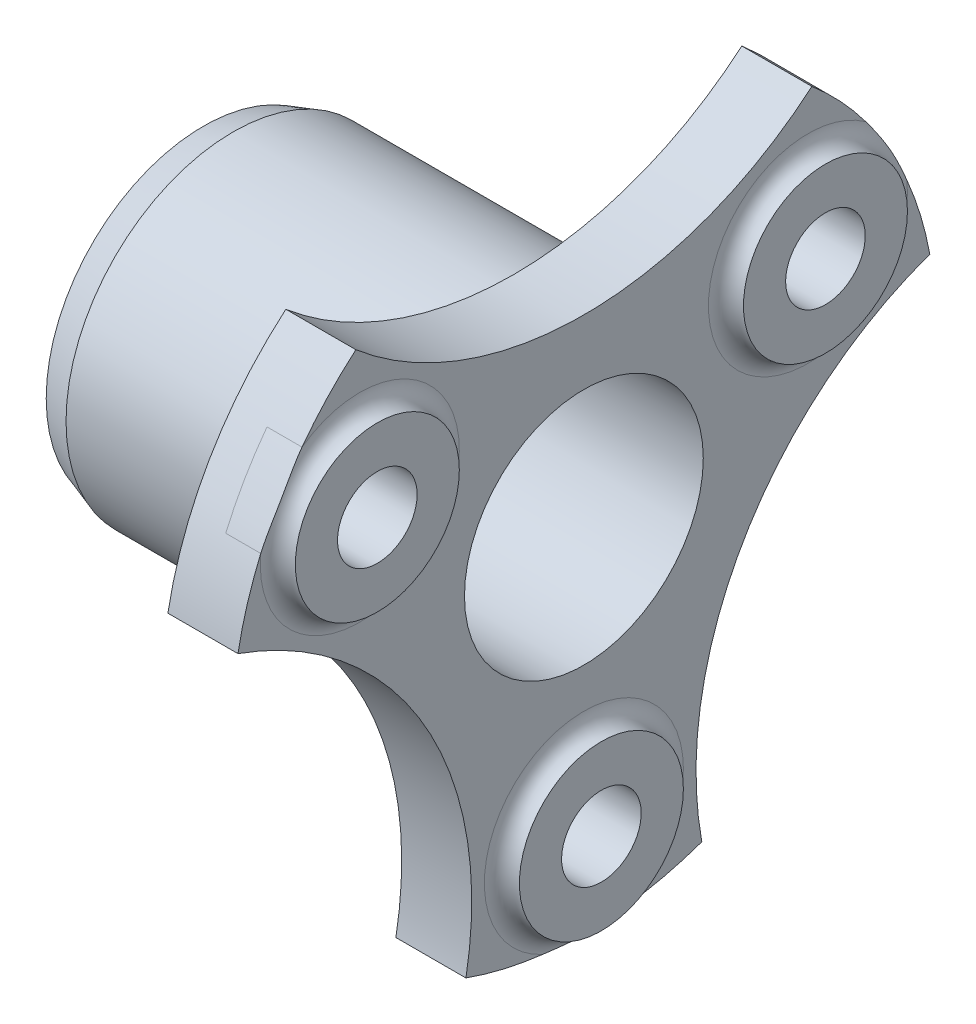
ISO-10303-21;
HEADER;
FILE_DESCRIPTION(('STEP AP214'),'2;1');
FILE_NAME('part.step','',(''),(''),'','','');
FILE_SCHEMA(('AUTOMOTIVE_DESIGN { 1 0 10303 214 1 1 1 1 }'));
ENDSEC;
DATA;
#1=APPLICATION_CONTEXT('core data for automotive mechanical design processes');
#2=APPLICATION_PROTOCOL_DEFINITION('international standard','automotive_design',2000,#1);
#3=PRODUCT_CONTEXT('',#1,'mechanical');
#4=PRODUCT('Part','Part','',(#3));
#5=PRODUCT_RELATED_PRODUCT_CATEGORY('part','',(#4));
#6=PRODUCT_DEFINITION_FORMATION('','',#4);
#7=PRODUCT_DEFINITION_CONTEXT('part definition',#1,'design');
#8=PRODUCT_DEFINITION('design','',#6,#7);
#9=PRODUCT_DEFINITION_SHAPE('','',#8);
#10=(LENGTH_UNIT() NAMED_UNIT(*) SI_UNIT(.MILLI.,.METRE.));
#11=(NAMED_UNIT(*) PLANE_ANGLE_UNIT() SI_UNIT($,.RADIAN.));
#12=(NAMED_UNIT(*) SI_UNIT($,.STERADIAN.) SOLID_ANGLE_UNIT());
#13=UNCERTAINTY_MEASURE_WITH_UNIT(LENGTH_MEASURE(1.E-05),#10,'distance_accuracy_value','');
#14=(GEOMETRIC_REPRESENTATION_CONTEXT(3) GLOBAL_UNCERTAINTY_ASSIGNED_CONTEXT((#13)) GLOBAL_UNIT_ASSIGNED_CONTEXT((#10,
#11,#12)) REPRESENTATION_CONTEXT('',''));
#15=CARTESIAN_POINT('',(0.,0.,0.));
#16=DIRECTION('',(0.,0.,1.));
#17=DIRECTION('',(1.,0.,0.));
#18=AXIS2_PLACEMENT_3D('',#15,#16,#17);
#19=CARTESIAN_POINT('',(0.,16.25,28.1458256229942));
#20=DIRECTION('',(-1.,0.,0.));
#21=DIRECTION('',(0.,-0.866025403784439,0.5));
#22=AXIS2_PLACEMENT_3D('',#19,#20,#21);
#23=TOROIDAL_SURFACE('',#22,12.5,2.2);
#24=CARTESIAN_POINT('',(0.,16.25,28.1458256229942));
#25=DIRECTION('',(-1.,0.,0.));
#26=DIRECTION('',(0.,-0.866025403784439,0.5));
#27=AXIS2_PLACEMENT_3D('',#24,#25,#26);
#28=CIRCLE('',#27,10.3);
#29=CARTESIAN_POINT('',(0.,7.32993834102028,33.2958256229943));
#30=VERTEX_POINT('',#29);
#31=EDGE_CURVE('E347',#30,#30,#28,.T.);
#32=ORIENTED_EDGE('',*,*,#31,.T.);
#33=EDGE_LOOP('',(#32));
#34=FACE_BOUND('',#33,.T.);
#35=CARTESIAN_POINT('',(-2.2,16.25,28.1458256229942));
#36=DIRECTION('',(-1.,0.,0.));
#37=DIRECTION('',(0.,0.5,0.866025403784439));
#38=AXIS2_PLACEMENT_3D('',#35,#36,#37);
#39=CIRCLE('',#38,12.5);
#40=CARTESIAN_POINT('',(-2.2,26.4258219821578,35.4054844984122));
#41=VERTEX_POINT('',#40);
#42=CARTESIAN_POINT('',(-2.2,17.4491380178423,40.58817540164));
#43=VERTEX_POINT('',#42);
#44=EDGE_CURVE('E206',#41,#43,#39,.T.);
#45=ORIENTED_EDGE('',*,*,#44,.F.);
#46=CARTESIAN_POINT('',(2.00000000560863E-07,30.4268934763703,32.032429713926));
#47=CARTESIAN_POINT('',(-0.0340599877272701,30.4268985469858,32.0324245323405));
#48=CARTESIAN_POINT('',(-0.0681012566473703,30.4257836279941,32.0334839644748));
#49=CARTESIAN_POINT('',(-0.135886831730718,30.4213691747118,32.0376764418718));
#50=CARTESIAN_POINT('',(-0.1696313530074,30.4180713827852,32.0408078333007));
#51=CARTESIAN_POINT('',(-0.269506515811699,30.4050629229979,32.053154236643));
#52=CARTESIAN_POINT('',(-0.334903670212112,30.3922349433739,32.0653236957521));
#53=CARTESIAN_POINT('',(-0.461810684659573,30.3592921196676,32.0965151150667));
#54=CARTESIAN_POINT('',(-0.523331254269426,30.3391984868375,32.115517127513));
#55=CARTESIAN_POINT('',(-0.642020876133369,30.2929322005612,32.1591616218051));
#56=CARTESIAN_POINT('',(-0.699180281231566,30.266746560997,32.1838161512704));
#57=CARTESIAN_POINT('',(-0.845469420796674,30.190327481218,32.2555542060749));
#58=CARTESIAN_POINT('',(-0.930370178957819,30.1357343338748,32.3066000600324));
#59=CARTESIAN_POINT('',(-1.08769602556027,30.0173110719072,32.4166625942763));
#60=CARTESIAN_POINT('',(-1.16008056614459,29.9534521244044,32.4757041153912));
#61=CARTESIAN_POINT('',(-1.28440447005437,29.8288243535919,32.5901792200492));
#62=CARTESIAN_POINT('',(-1.33778738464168,29.7688717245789,32.6449631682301));
#63=CARTESIAN_POINT('',(-1.43739418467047,29.6454518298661,32.7570838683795));
#64=CARTESIAN_POINT('',(-1.4836125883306,29.5819819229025,32.8144225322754));
#65=CARTESIAN_POINT('',(-1.56975028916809,29.4523969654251,32.9307804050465));
#66=CARTESIAN_POINT('',(-1.60966917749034,29.3862817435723,32.9897997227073));
#67=CARTESIAN_POINT('',(-1.68398268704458,29.2519660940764,33.10895586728));
#68=CARTESIAN_POINT('',(-1.71837516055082,29.183764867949,33.1690931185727));
#69=CARTESIAN_POINT('',(-1.81566695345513,28.9736527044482,33.3531848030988));
#70=CARTESIAN_POINT('',(-1.87085029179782,28.8291103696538,33.478230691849));
#71=CARTESIAN_POINT('',(-1.96531317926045,28.5353864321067,33.7289423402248));
#72=CARTESIAN_POINT('',(-2.00457496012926,28.3861998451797,33.8546086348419));
#73=CARTESIAN_POINT('',(-2.07053314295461,28.0837647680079,34.1059144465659));
#74=CARTESIAN_POINT('',(-2.09716390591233,27.9304993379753,34.2315505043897));
#75=CARTESIAN_POINT('',(-2.12936998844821,27.6987775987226,34.4188900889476));
#76=CARTESIAN_POINT('',(-2.13881370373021,27.6212560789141,34.4811327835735));
#77=CARTESIAN_POINT('',(-2.15539390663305,27.4656500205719,34.6052072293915));
#78=CARTESIAN_POINT('',(-2.16253061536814,27.3875655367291,34.66703901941));
#79=CARTESIAN_POINT('',(-2.18295985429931,27.1257317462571,34.8729343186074));
#80=CARTESIAN_POINT('',(-2.19165877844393,26.9408216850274,35.015984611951));
#81=CARTESIAN_POINT('',(-2.20066541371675,26.5686100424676,35.2992364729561));
#82=CARTESIAN_POINT('',(-2.20097083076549,26.3813078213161,35.4394372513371));
#83=CARTESIAN_POINT('',(-2.19564288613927,26.0043633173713,35.7169472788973));
#84=CARTESIAN_POINT('',(-2.19000310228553,25.8147187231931,35.8542532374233));
#85=CARTESIAN_POINT('',(-2.17500337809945,25.433366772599,36.1257671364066));
#86=CARTESIAN_POINT('',(-2.16564319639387,25.2416592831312,36.2599748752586));
#87=CARTESIAN_POINT('',(-2.14522384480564,24.8558107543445,36.525553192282));
#88=CARTESIAN_POINT('',(-2.13416127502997,24.6616655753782,36.6569174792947));
#89=CARTESIAN_POINT('',(-2.1122194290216,24.271298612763,36.9165465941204));
#90=CARTESIAN_POINT('',(-2.10134015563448,24.0750767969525,37.0448113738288));
#91=CARTESIAN_POINT('',(-2.08140376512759,23.6807141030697,37.2981374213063));
#92=CARTESIAN_POINT('',(-2.07234511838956,23.4825749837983,37.4232013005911));
#93=CARTESIAN_POINT('',(-2.05732980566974,23.0842465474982,37.6702120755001));
#94=CARTESIAN_POINT('',(-2.05137307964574,22.8840572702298,37.7921590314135));
#95=CARTESIAN_POINT('',(-2.04340256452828,22.4819175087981,38.0327572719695));
#96=CARTESIAN_POINT('',(-2.04138456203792,22.2799691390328,38.1514119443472));
#97=CARTESIAN_POINT('',(-2.04156117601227,21.8742113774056,38.3854938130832));
#98=CARTESIAN_POINT('',(-2.0437558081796,21.6704019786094,38.5009209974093));
#99=CARTESIAN_POINT('',(-2.05205272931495,21.2609317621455,38.7285434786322));
#100=CARTESIAN_POINT('',(-2.05815702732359,21.0552700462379,38.8407370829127));
#101=CARTESIAN_POINT('',(-2.07341822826,20.6422796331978,39.0617914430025));
#102=CARTESIAN_POINT('',(-2.08257514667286,20.4349509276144,39.1706521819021));
#103=CARTESIAN_POINT('',(-2.10263139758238,20.0187621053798,39.3849758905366));
#104=CARTESIAN_POINT('',(-2.11352986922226,19.8099027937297,39.4904405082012));
#105=CARTESIAN_POINT('',(-2.13544036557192,19.3905399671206,39.6980364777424));
#106=CARTESIAN_POINT('',(-2.14645239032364,19.1800364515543,39.8001678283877));
#107=CARTESIAN_POINT('',(-2.16671949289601,18.757451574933,40.001064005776));
#108=CARTESIAN_POINT('',(-2.17597531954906,18.5453709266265,40.0998302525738));
#109=CARTESIAN_POINT('',(-2.19069016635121,18.1195648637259,40.2940257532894));
#110=CARTESIAN_POINT('',(-2.19614956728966,17.9058396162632,40.3894553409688));
#111=CARTESIAN_POINT('',(-2.20016413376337,17.5531300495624,40.5435910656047));
#112=CARTESIAN_POINT('',(-2.20048431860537,17.4145993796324,40.6032865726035));
#113=CARTESIAN_POINT('',(-2.19796501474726,17.1369635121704,40.721242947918));
#114=CARTESIAN_POINT('',(-2.19512575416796,16.9978583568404,40.7795039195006));
#115=CARTESIAN_POINT('',(-2.18557572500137,16.7189432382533,40.8946467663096));
#116=CARTESIAN_POINT('',(-2.17885878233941,16.5791325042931,40.9515262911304));
#117=CARTESIAN_POINT('',(-2.16076467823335,16.2991872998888,41.0637508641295));
#118=CARTESIAN_POINT('',(-2.14938743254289,16.1590528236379,41.1190958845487));
#119=CARTESIAN_POINT('',(-2.1184071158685,15.8520815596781,41.2385248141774));
#120=CARTESIAN_POINT('',(-2.09765248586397,15.6852259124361,41.3022731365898));
#121=CARTESIAN_POINT('',(-2.046567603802,15.3520508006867,41.4272684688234));
#122=CARTESIAN_POINT('',(-2.01623964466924,15.185731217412,41.488516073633));
#123=CARTESIAN_POINT('',(-1.94396721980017,14.855074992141,41.6080516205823));
#124=CARTESIAN_POINT('',(-1.9020566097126,14.6907340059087,41.6663476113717));
#125=CARTESIAN_POINT('',(-1.80390836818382,14.3653059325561,41.7796597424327));
#126=CARTESIAN_POINT('',(-1.74768715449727,14.2042153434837,41.8346795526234));
#127=CARTESIAN_POINT('',(-1.6370851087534,13.9360189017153,41.92461452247));
#128=CARTESIAN_POINT('',(-1.5873241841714,13.8273668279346,41.9605635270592));
#129=CARTESIAN_POINT('',(-1.47741822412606,13.6144188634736,42.0301383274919));
#130=CARTESIAN_POINT('',(-1.41726317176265,13.5101272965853,42.063761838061));
#131=CARTESIAN_POINT('',(-1.28410806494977,13.3076318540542,42.1282650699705));
#132=CARTESIAN_POINT('',(-1.21100010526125,13.2094893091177,42.1591181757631));
#133=CARTESIAN_POINT('',(-1.05008823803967,13.0245972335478,42.216602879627));
#134=CARTESIAN_POINT('',(-0.9623215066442,12.9378198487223,42.2432448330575));
#135=CARTESIAN_POINT('',(-0.807852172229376,12.8127928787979,42.2812870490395));
#136=CARTESIAN_POINT('',(-0.746275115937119,12.768812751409,42.2945803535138));
#137=CARTESIAN_POINT('',(-0.617029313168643,12.6898457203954,42.3183401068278));
#138=CARTESIAN_POINT('',(-0.549364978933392,12.6548523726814,42.328808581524));
#139=CARTESIAN_POINT('',(-0.416864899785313,12.5997352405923,42.3452453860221));
#140=CARTESIAN_POINT('',(-0.352601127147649,12.5783629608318,42.3515931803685));
#141=CARTESIAN_POINT('',(-0.221306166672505,12.546306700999,42.3611011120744));
#142=CARTESIAN_POINT('',(-0.154282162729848,12.5355966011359,42.3642690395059));
#143=CARTESIAN_POINT('',(-0.0579529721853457,12.5285037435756,42.366366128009));
#144=CARTESIAN_POINT('',(-0.0289709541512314,12.5274315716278,42.3666828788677));
#145=CARTESIAN_POINT('',(1.99999997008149E-07,12.5274511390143,42.3666775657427));
#146=B_SPLINE_CURVE_WITH_KNOTS('',3,(#46,#47,#48,#49,#50,#51,#52,#53,#54,#55,#56,#57,#58,#59,
#60,#61,#62,#63,#64,#65,#66,#67,#68,#69,#70,#71,#72,#73,#74,#75,#76,#77,#78,#79,#80,#81,#82,#83,
#84,#85,#86,#87,#88,#89,#90,#91,#92,#93,#94,#95,#96,#97,#98,#99,#100,#101,#102,#103,#104,#105,
#106,#107,#108,#109,#110,#111,#112,#113,#114,#115,#116,#117,#118,#119,#120,#121,#122,#123,#124,
#125,#126,#127,#128,#129,#130,#131,#132,#133,#134,#135,#136,#137,#138,#139,#140,#141,#142,#143,
#144,#145),.UNSPECIFIED.,.F.,.F.,(4,2,2,2,2,2,2,2,2,2,2,2,2,2,2,2,2,2,2,2,2,2,2,2,2,2,2,2,2,2,2,
2,2,2,2,2,2,2,2,2,2,2,2,2,2,2,2,2,2,4),(0.,0.102110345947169,0.204139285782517,
0.406348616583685,0.60797232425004,0.810029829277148,1.14742165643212,1.48588682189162,
1.77703153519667,2.06839792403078,2.35978321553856,2.6512814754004,3.24704691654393,
3.84347540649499,4.44297025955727,4.7425420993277,5.0420852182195,5.74365582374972,
6.44541817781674,7.14793937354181,7.85050615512,8.55449471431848,9.25849419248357,
9.96189970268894,10.665291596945,11.3679306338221,12.0705722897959,12.7735752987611,
13.476581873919,14.1792420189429,14.8819024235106,15.5842625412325,16.2865522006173,
16.7390560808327,17.1915272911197,17.6447209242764,18.0979227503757,18.6371598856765,
19.1762679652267,19.7138166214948,20.2507513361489,20.6247296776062,20.9990704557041,
21.3766904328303,21.7533668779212,21.9832091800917,22.2128862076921,22.4161071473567,
22.6188290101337,22.7057547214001),.UNSPECIFIED.);
#147=EDGE_CURVE('E245',#41,#43,#146,.T.);
#148=ORIENTED_EDGE('',*,*,#147,.T.);
#149=EDGE_LOOP('',(#45,#148));
#150=FACE_BOUND('',#149,.T.);
#151=ADVANCED_FACE('F12',(#34,#150),#23,.F.);
#152=CARTESIAN_POINT('',(0.,16.25,-28.1458256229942));
#153=DIRECTION('',(-1.,0.,0.));
#154=DIRECTION('',(0.,0.866025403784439,0.5));
#155=AXIS2_PLACEMENT_3D('',#152,#153,#154);
#156=TOROIDAL_SURFACE('',#155,12.5,2.2);
#157=CARTESIAN_POINT('',(0.,16.25,-28.1458256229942));
#158=DIRECTION('',(-1.,0.,0.));
#159=DIRECTION('',(0.,0.866025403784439,0.5));
#160=AXIS2_PLACEMENT_3D('',#157,#158,#159);
#161=CIRCLE('',#160,10.3);
#162=CARTESIAN_POINT('',(0.,25.1700616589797,-22.9958256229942));
#163=VERTEX_POINT('',#162);
#164=EDGE_CURVE('E376',#163,#163,#161,.T.);
#165=ORIENTED_EDGE('',*,*,#164,.T.);
#166=EDGE_LOOP('',(#165));
#167=FACE_BOUND('',#166,.T.);
#168=CARTESIAN_POINT('',(-2.2,16.25,-28.1458256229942));
#169=DIRECTION('',(-1.,0.,0.));
#170=DIRECTION('',(0.,0.5,0.866025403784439));
#171=AXIS2_PLACEMENT_3D('',#168,#169,#170);
#172=CIRCLE('',#171,12.5);
#173=CARTESIAN_POINT('',(-2.2,17.4491380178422,-40.58817540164));
#174=VERTEX_POINT('',#173);
#175=CARTESIAN_POINT('',(-2.2,26.4258219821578,-35.4054844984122));
#176=VERTEX_POINT('',#175);
#177=EDGE_CURVE('E212',#174,#176,#172,.T.);
#178=ORIENTED_EDGE('',*,*,#177,.F.);
#179=CARTESIAN_POINT('',(-1.89565730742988,14.6763753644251,-41.6710499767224));
#180=CARTESIAN_POINT('',(-1.93140408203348,14.8069866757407,-41.6250533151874));
#181=CARTESIAN_POINT('',(-1.96292795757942,14.9383367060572,-41.5780982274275));
#182=CARTESIAN_POINT('',(-2.01863762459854,15.2018501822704,-41.4824744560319));
#183=CARTESIAN_POINT('',(-2.0428294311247,15.3340128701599,-41.4338072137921));
#184=CARTESIAN_POINT('',(-2.08494005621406,15.5980916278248,-41.3351151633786));
#185=CARTESIAN_POINT('',(-2.10288739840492,15.7300060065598,-41.2850976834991));
#186=CARTESIAN_POINT('',(-2.13354849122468,15.993897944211,-41.1835843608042));
#187=CARTESIAN_POINT('',(-2.14626104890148,16.125875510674,-41.1320881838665));
#188=CARTESIAN_POINT('',(-2.1776384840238,16.5202947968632,-40.9759922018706));
#189=CARTESIAN_POINT('',(-2.18972179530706,16.7824441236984,-40.8693288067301));
#190=CARTESIAN_POINT('',(-2.20146646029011,17.305201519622,-40.6507424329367));
#191=CARTESIAN_POINT('',(-2.20110809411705,17.5658064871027,-40.5388113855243));
#192=CARTESIAN_POINT('',(-2.19340588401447,18.0172808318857,-40.3397328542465));
#193=CARTESIAN_POINT('',(-2.18790063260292,18.2086815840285,-40.2536995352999));
#194=CARTESIAN_POINT('',(-2.17401270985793,18.5901535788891,-40.078954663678));
#195=CARTESIAN_POINT('',(-2.16562994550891,18.7802247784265,-39.9902430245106));
#196=CARTESIAN_POINT('',(-2.14745431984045,19.159089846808,-39.8101204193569));
#197=CARTESIAN_POINT('',(-2.13766098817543,19.3478832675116,-39.7187085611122));
#198=CARTESIAN_POINT('',(-2.11801740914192,19.7241403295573,-39.5332098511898));
#199=CARTESIAN_POINT('',(-2.10816716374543,19.9116040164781,-39.4391230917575));
#200=CARTESIAN_POINT('',(-2.08961645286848,20.2851823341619,-39.248283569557));
#201=CARTESIAN_POINT('',(-2.08091576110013,20.4712972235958,-39.1515313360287));
#202=CARTESIAN_POINT('',(-2.0656684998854,20.8422008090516,-38.9553472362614));
#203=CARTESIAN_POINT('',(-2.05912192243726,21.0269895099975,-38.8559153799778));
#204=CARTESIAN_POINT('',(-2.04892651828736,21.3951287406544,-38.6544289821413));
#205=CARTESIAN_POINT('',(-2.04527665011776,21.5784797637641,-38.5523753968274));
#206=CARTESIAN_POINT('',(-2.04128186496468,21.9437366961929,-38.3456497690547));
#207=CARTESIAN_POINT('',(-2.04093693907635,22.1256426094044,-38.2409777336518));
#208=CARTESIAN_POINT('',(-2.04360295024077,22.4895270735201,-38.0281263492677));
#209=CARTESIAN_POINT('',(-2.04664358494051,22.6714920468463,-37.9199241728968));
#210=CARTESIAN_POINT('',(-2.0557802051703,23.033789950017,-37.7009512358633));
#211=CARTESIAN_POINT('',(-2.06187619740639,23.2141228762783,-37.5901804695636));
#212=CARTESIAN_POINT('',(-2.07642502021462,23.5731744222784,-37.3660628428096));
#213=CARTESIAN_POINT('',(-2.0848787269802,23.751892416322,-37.2527150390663));
#214=CARTESIAN_POINT('',(-2.10315241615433,24.1076326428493,-37.0234955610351));
#215=CARTESIAN_POINT('',(-2.11297241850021,24.2846548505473,-36.9076238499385));
#216=CARTESIAN_POINT('',(-2.13281702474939,24.6377894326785,-36.672835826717));
#217=CARTESIAN_POINT('',(-2.1428423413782,24.8138943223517,-36.553908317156));
#218=CARTESIAN_POINT('',(-2.16166929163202,25.1644036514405,-36.3135009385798));
#219=CARTESIAN_POINT('',(-2.17047100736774,25.3388082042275,-36.1920212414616));
#220=CARTESIAN_POINT('',(-2.18534670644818,25.6858647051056,-35.9465423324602));
#221=CARTESIAN_POINT('',(-2.19142175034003,25.8585173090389,-35.8225441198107));
#222=CARTESIAN_POINT('',(-2.19918596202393,26.2021178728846,-35.5719925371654));
#223=CARTESIAN_POINT('',(-2.200874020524,26.3730653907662,-35.4454385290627));
#224=CARTESIAN_POINT('',(-2.19953483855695,26.5431062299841,-35.3176430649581));
#225=B_SPLINE_CURVE_WITH_KNOTS('',3,(#179,#180,#181,#182,#183,#184,#185,#186,#187,#188,#189,
#190,#191,#192,#193,#194,#195,#196,#197,#198,#199,#200,#201,#202,#203,#204,#205,#206,#207,#208,
#209,#210,#211,#212,#213,#214,#215,#216,#217,#218,#219,#220,#221,#222,#223,#224),.UNSPECIFIED.,
.F.,.F.,(4,2,2,2,2,2,2,2,2,2,2,2,2,2,2,2,2,2,2,2,2,2,4),(0.,0.428867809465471,0.85738282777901,
1.28391394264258,1.71054220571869,2.55986049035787,3.4105249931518,4.04023702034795,
4.66996940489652,5.29991225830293,5.92983341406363,6.55963038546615,7.18942501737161,
7.81899311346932,8.44855951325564,9.08369219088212,9.71882626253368,10.3541966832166,
10.9895763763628,11.627765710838,12.2659121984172,12.9038102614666,13.5418696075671),.UNSPECIFIED.);
#226=EDGE_CURVE('E239',#174,#176,#225,.T.);
#227=ORIENTED_EDGE('',*,*,#226,.T.);
#228=EDGE_LOOP('',(#178,#227));
#229=FACE_BOUND('',#228,.T.);
#230=ADVANCED_FACE('F253',(#167,#229),#156,.F.);
#231=CARTESIAN_POINT('',(0.,-32.5,0.));
#232=DIRECTION('',(-1.,0.,0.));
#233=DIRECTION('',(0.,0.,-1.));
#234=AXIS2_PLACEMENT_3D('',#231,#232,#233);
#235=TOROIDAL_SURFACE('',#234,12.5,2.2);
#236=CARTESIAN_POINT('',(0.,-32.5,0.));
#237=DIRECTION('',(-1.,0.,0.));
#238=DIRECTION('',(0.,0.,-1.));
#239=AXIS2_PLACEMENT_3D('',#236,#237,#238);
#240=CIRCLE('',#239,10.3);
#241=CARTESIAN_POINT('',(0.,-32.5,-10.3));
#242=VERTEX_POINT('',#241);
#243=EDGE_CURVE('E137',#242,#242,#240,.T.);
#244=ORIENTED_EDGE('',*,*,#243,.T.);
#245=EDGE_LOOP('',(#244));
#246=FACE_BOUND('',#245,.T.);
#247=CARTESIAN_POINT('',(-2.2,-32.5,0.));
#248=DIRECTION('',(-1.,0.,0.));
#249=DIRECTION('',(0.,0.5,0.866025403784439));
#250=AXIS2_PLACEMENT_3D('',#247,#248,#249);
#251=CIRCLE('',#250,12.5);
#252=CARTESIAN_POINT('',(-2.2,-43.87496,5.18269090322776));
#253=VERTEX_POINT('',#252);
#254=CARTESIAN_POINT('',(-2.2,-43.87496,-5.18269090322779));
#255=VERTEX_POINT('',#254);
#256=EDGE_CURVE('E124',#253,#255,#251,.T.);
#257=ORIENTED_EDGE('',*,*,#256,.F.);
#258=CARTESIAN_POINT('',(-2.19953483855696,-43.857529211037,5.3281827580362));
#259=CARTESIAN_POINT('',(-2.20069857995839,-43.8796701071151,5.14593892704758));
#260=CARTESIAN_POINT('',(-2.19959772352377,-43.9006732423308,4.96356615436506));
#261=CARTESIAN_POINT('',(-2.19395411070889,-43.9403961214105,4.59865811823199));
#262=CARTESIAN_POINT('',(-2.18941203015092,-43.9591163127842,4.41612289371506));
#263=CARTESIAN_POINT('',(-2.17797005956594,-43.9942827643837,4.05082406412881));
#264=CARTESIAN_POINT('',(-2.17106901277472,-44.0107279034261,3.86806039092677));
#265=CARTESIAN_POINT('',(-2.15590244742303,-44.0413365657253,3.50239025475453));
#266=CARTESIAN_POINT('',(-2.147636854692,-44.0554999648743,3.3194837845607));
#267=CARTESIAN_POINT('',(-2.13065309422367,-44.0815770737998,2.95309553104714));
#268=CARTESIAN_POINT('',(-2.12193389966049,-44.0934853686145,2.7696134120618));
#269=CARTESIAN_POINT('',(-2.1049198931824,-44.1150111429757,2.40249864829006));
#270=CARTESIAN_POINT('',(-2.09662507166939,-44.1246286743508,2.21886600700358));
#271=CARTESIAN_POINT('',(-2.08122409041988,-44.1415661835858,1.85156951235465));
#272=CARTESIAN_POINT('',(-2.07411712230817,-44.1488877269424,1.66790576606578));
#273=CARTESIAN_POINT('',(-2.06171248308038,-44.1612394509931,1.30043346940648));
#274=CARTESIAN_POINT('',(-2.05641485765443,-44.1662695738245,1.11662491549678));
#275=CARTESIAN_POINT('',(-2.04848432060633,-44.1736658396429,0.766382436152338));
#276=CARTESIAN_POINT('',(-2.0456459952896,-44.1762397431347,0.599957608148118));
#277=CARTESIAN_POINT('',(-2.04202744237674,-44.1795063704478,0.267065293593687));
#278=CARTESIAN_POINT('',(-2.04124722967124,-44.1801990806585,0.100597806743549));
#279=CARTESIAN_POINT('',(-2.04180263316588,-44.1797027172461,-0.232333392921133));
#280=CARTESIAN_POINT('',(-2.04313828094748,-44.178513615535,-0.398797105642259));
#281=CARTESIAN_POINT('',(-2.04782372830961,-44.1742545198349,-0.731673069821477));
#282=CARTESIAN_POINT('',(-2.05117355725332,-44.1711844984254,-0.898085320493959));
#283=CARTESIAN_POINT('',(-2.06394223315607,-44.1591385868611,-1.39790019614));
#284=CARTESIAN_POINT('',(-2.07607750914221,-44.1473279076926,-1.73116824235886));
#285=CARTESIAN_POINT('',(-2.1042089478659,-44.116178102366,-2.39716154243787));
#286=CARTESIAN_POINT('',(-2.12020507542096,-44.0968390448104,-2.72988680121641));
#287=CARTESIAN_POINT('',(-2.15105033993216,-44.0508733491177,-3.39142122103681));
#288=CARTESIAN_POINT('',(-2.16590965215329,-44.0243243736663,-3.72023520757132));
#289=CARTESIAN_POINT('',(-2.18914674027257,-43.9638314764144,-4.37754412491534));
#290=CARTESIAN_POINT('',(-2.19752245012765,-43.9298852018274,-4.70603892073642));
#291=CARTESIAN_POINT('',(-2.20154907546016,-43.8547358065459,-5.3612306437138));
#292=CARTESIAN_POINT('',(-2.19724470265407,-43.8135586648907,-5.68792982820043));
#293=CARTESIAN_POINT('',(-2.17586938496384,-43.7464342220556,-6.17648130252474));
#294=CARTESIAN_POINT('',(-2.1662636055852,-43.7231750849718,-6.33902735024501));
#295=CARTESIAN_POINT('',(-2.14100072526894,-43.6749198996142,-6.66337985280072));
#296=CARTESIAN_POINT('',(-2.12534483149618,-43.6499241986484,-6.82518644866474));
#297=CARTESIAN_POINT('',(-2.09457335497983,-43.6087450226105,-7.08231569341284));
#298=CARTESIAN_POINT('',(-2.08181004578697,-43.5930954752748,-7.17800729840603));
#299=CARTESIAN_POINT('',(-2.05340213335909,-43.561233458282,-7.36890124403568));
#300=CARTESIAN_POINT('',(-2.03775668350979,-43.5450208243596,-7.46410343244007));
#301=CARTESIAN_POINT('',(-2.00319384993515,-43.5120105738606,-7.65419290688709));
#302=CARTESIAN_POINT('',(-1.98426451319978,-43.4952110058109,-7.74907770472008));
#303=CARTESIAN_POINT('',(-1.94277943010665,-43.4611366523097,-7.93796159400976));
#304=CARTESIAN_POINT('',(-1.92022370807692,-43.443861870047,-8.03196069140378));
#305=CARTESIAN_POINT('',(-1.8956573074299,-43.4263755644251,-8.12541108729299));
#306=B_SPLINE_CURVE_WITH_KNOTS('',3,(#258,#259,#260,#261,#262,#263,#264,#265,#266,#267,#268,
#269,#270,#271,#272,#273,#274,#275,#276,#277,#278,#279,#280,#281,#282,#283,#284,#285,#286,#287,
#288,#289,#290,#291,#292,#293,#294,#295,#296,#297,#298,#299,#300,#301,#302,#303,#304,#305),
.UNSPECIFIED.,.F.,.F.,(4,2,2,2,2,2,2,2,2,2,2,2,2,2,2,2,2,2,2,2,2,2,2,4),(0.,0.550711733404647,
1.10131534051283,1.65218933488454,2.20309328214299,2.75530373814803,3.30750169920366,
3.8593223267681,4.41115688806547,4.91054155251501,5.40992983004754,5.90932556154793,
6.4087285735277,7.40967169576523,8.41060569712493,9.40115860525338,10.3920270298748,
11.379405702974,11.872760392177,12.366016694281,12.6593766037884,12.9528228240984,
13.2473604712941,13.5418961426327),.UNSPECIFIED.);
#307=EDGE_CURVE('E9',#253,#255,#306,.T.);
#308=ORIENTED_EDGE('',*,*,#307,.T.);
#309=EDGE_LOOP('',(#257,#308));
#310=FACE_BOUND('',#309,.T.);
#311=ADVANCED_FACE('F125',(#246,#310),#235,.F.);
#312=CARTESIAN_POINT('',(-11.,-16.82,29.1330945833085));
#313=DIRECTION('',(-1.,0.,0.));
#314=DIRECTION('',(0.,0.,1.));
#315=AXIS2_PLACEMENT_3D('',#312,#313,#314);
#316=PLANE('',#315);
#317=CARTESIAN_POINT('',(-11.,-32.5,0.));
#318=DIRECTION('',(-1.,0.,0.));
#319=DIRECTION('',(0.,0.5,0.866025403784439));
#320=AXIS2_PLACEMENT_3D('',#317,#318,#319);
#321=CIRCLE('',#320,5.);
#322=CARTESIAN_POINT('',(-11.,-30.,4.33012701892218));
#323=VERTEX_POINT('',#322);
#324=EDGE_CURVE('E401',#323,#323,#321,.T.);
#325=ORIENTED_EDGE('',*,*,#324,.F.);
#326=EDGE_LOOP('',(#325));
#327=FACE_BOUND('',#326,.T.);
#328=CARTESIAN_POINT('',(-11.,-33.64,58.266189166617));
#329=DIRECTION('',(-1.,0.,0.));
#330=DIRECTION('',(0.,1.,0.));
#331=AXIS2_PLACEMENT_3D('',#328,#329,#330);
#332=CIRCLE('',#331,44.18);
#333=CARTESIAN_POINT('',(-11.,-11.55,20.0051868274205));
#334=VERTEX_POINT('',#333);
#335=CARTESIAN_POINT('',(-11.,-41.6225623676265,14.8133285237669));
#336=VERTEX_POINT('',#335);
#337=EDGE_CURVE('E165',#334,#336,#332,.T.);
#338=ORIENTED_EDGE('',*,*,#337,.F.);
#339=CARTESIAN_POINT('',(-11.,0.,0.));
#340=DIRECTION('',(-1.,0.,0.));
#341=DIRECTION('',(0.,0.,1.));
#342=AXIS2_PLACEMENT_3D('',#339,#340,#341);
#343=CIRCLE('',#342,23.1);
#344=CARTESIAN_POINT('',(-11.,-11.55,-20.0051868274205));
#345=VERTEX_POINT('',#344);
#346=EDGE_CURVE('E202',#334,#345,#343,.F.);
#347=ORIENTED_EDGE('',*,*,#346,.T.);
#348=CARTESIAN_POINT('',(-11.,-33.64,-58.266189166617));
#349=DIRECTION('',(-1.,0.,0.));
#350=DIRECTION('',(0.,1.,0.));
#351=AXIS2_PLACEMENT_3D('',#348,#349,#350);
#352=CIRCLE('',#351,44.18);
#353=CARTESIAN_POINT('',(-11.,-41.6225623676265,-14.8133285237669));
#354=VERTEX_POINT('',#353);
#355=EDGE_CURVE('E172',#354,#345,#352,.T.);
#356=ORIENTED_EDGE('',*,*,#355,.F.);
#357=CARTESIAN_POINT('',(-11.,0.,0.));
#358=DIRECTION('',(-1.,0.,0.));
#359=DIRECTION('',(0.,1.,0.));
#360=AXIS2_PLACEMENT_3D('',#357,#358,#359);
#361=CIRCLE('',#360,44.18);
#362=EDGE_CURVE('E167',#354,#336,#361,.T.);
#363=ORIENTED_EDGE('',*,*,#362,.T.);
#364=EDGE_LOOP('',(#338,#347,#356,#363));
#365=FACE_BOUND('',#364,.T.);
#366=ADVANCED_FACE('F289',(#327,#365),#316,.T.);
#367=CARTESIAN_POINT('',(-11.,16.25,-28.1458256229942));
#368=DIRECTION('',(-1.,0.,0.));
#369=DIRECTION('',(0.,0.5,0.866025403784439));
#370=AXIS2_PLACEMENT_3D('',#367,#368,#369);
#371=CIRCLE('',#370,5.);
#372=CARTESIAN_POINT('',(-11.,18.75,-23.8156986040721));
#373=VERTEX_POINT('',#372);
#374=EDGE_CURVE('E396',#373,#373,#371,.T.);
#375=ORIENTED_EDGE('',*,*,#374,.F.);
#376=EDGE_LOOP('',(#375));
#377=FACE_BOUND('',#376,.T.);
#378=CARTESIAN_POINT('',(-11.,7.98256236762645,-43.4528606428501));
#379=VERTEX_POINT('',#378);
#380=EDGE_CURVE('E170',#345,#379,#352,.T.);
#381=ORIENTED_EDGE('',*,*,#380,.F.);
#382=CARTESIAN_POINT('',(-11.,23.1,0.));
#383=VERTEX_POINT('',#382);
#384=EDGE_CURVE('E200',#345,#383,#343,.F.);
#385=ORIENTED_EDGE('',*,*,#384,.T.);
#386=CARTESIAN_POINT('',(-11.,67.28,0.));
#387=DIRECTION('',(-1.,0.,0.));
#388=DIRECTION('',(0.,1.,0.));
#389=AXIS2_PLACEMENT_3D('',#386,#387,#388);
#390=CIRCLE('',#389,44.18);
#391=CARTESIAN_POINT('',(-11.,33.64,-28.6395321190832));
#392=VERTEX_POINT('',#391);
#393=EDGE_CURVE('E179',#392,#383,#390,.T.);
#394=ORIENTED_EDGE('',*,*,#393,.F.);
#395=CARTESIAN_POINT('',(-11.,0.,0.));
#396=DIRECTION('',(-1.,0.,0.));
#397=DIRECTION('',(0.,1.,0.));
#398=AXIS2_PLACEMENT_3D('',#395,#396,#397);
#399=CIRCLE('',#398,44.18);
#400=EDGE_CURVE('E175',#392,#379,#399,.T.);
#401=ORIENTED_EDGE('',*,*,#400,.T.);
#402=EDGE_LOOP('',(#381,#385,#394,#401));
#403=FACE_BOUND('',#402,.T.);
#404=ADVANCED_FACE('F292',(#377,#403),#316,.T.);
#405=CARTESIAN_POINT('',(-11.,16.25,28.1458256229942));
#406=DIRECTION('',(-1.,0.,0.));
#407=DIRECTION('',(0.,0.5,0.866025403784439));
#408=AXIS2_PLACEMENT_3D('',#405,#406,#407);
#409=CIRCLE('',#408,5.);
#410=CARTESIAN_POINT('',(-11.,18.75,32.4759526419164));
#411=VERTEX_POINT('',#410);
#412=EDGE_CURVE('E246',#411,#411,#409,.T.);
#413=ORIENTED_EDGE('',*,*,#412,.F.);
#414=EDGE_LOOP('',(#413));
#415=FACE_BOUND('',#414,.T.);
#416=CARTESIAN_POINT('',(-11.,33.64,28.6395321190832));
#417=VERTEX_POINT('',#416);
#418=EDGE_CURVE('E178',#383,#417,#390,.T.);
#419=ORIENTED_EDGE('',*,*,#418,.F.);
#420=CARTESIAN_POINT('',(-11.,0.,0.));
#421=DIRECTION('',(1.,0.,0.));
#422=DIRECTION('',(0.,0.,-1.));
#423=AXIS2_PLACEMENT_3D('',#420,#421,#422);
#424=CIRCLE('',#423,23.1);
#425=EDGE_CURVE('E357',#383,#334,#424,.T.);
#426=ORIENTED_EDGE('',*,*,#425,.T.);
#427=CARTESIAN_POINT('',(-11.,7.98256236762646,43.4528606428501));
#428=VERTEX_POINT('',#427);
#429=EDGE_CURVE('E171',#428,#334,#332,.T.);
#430=ORIENTED_EDGE('',*,*,#429,.F.);
#431=CARTESIAN_POINT('',(-11.,0.,0.));
#432=DIRECTION('',(-1.,0.,0.));
#433=DIRECTION('',(0.,1.,0.));
#434=AXIS2_PLACEMENT_3D('',#431,#432,#433);
#435=CIRCLE('',#434,44.18);
#436=EDGE_CURVE('E182',#428,#417,#435,.T.);
#437=ORIENTED_EDGE('',*,*,#436,.T.);
#438=EDGE_LOOP('',(#419,#426,#430,#437));
#439=FACE_BOUND('',#438,.T.);
#440=ADVANCED_FACE('F294',(#415,#439),#316,.T.);
#441=CARTESIAN_POINT('',(-11.,-33.64,58.266189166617));
#442=DIRECTION('',(1.,0.,0.));
#443=DIRECTION('',(0.,0.,-1.));
#444=AXIS2_PLACEMENT_3D('',#441,#442,#443);
#445=CYLINDRICAL_SURFACE('',#444,44.18);
#446=CARTESIAN_POINT('',(-2.2,-33.64,58.266189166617));
#447=DIRECTION('',(-1.,0.,0.));
#448=DIRECTION('',(0.,1.,0.));
#449=AXIS2_PLACEMENT_3D('',#446,#447,#448);
#450=CIRCLE('',#449,44.18);
#451=CARTESIAN_POINT('',(-2.2,7.98256236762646,43.4528606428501));
#452=VERTEX_POINT('',#451);
#453=CARTESIAN_POINT('',(-2.2,-41.6225623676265,14.8133285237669));
#454=VERTEX_POINT('',#453);
#455=EDGE_CURVE('E143',#452,#454,#450,.T.);
#456=ORIENTED_EDGE('',*,*,#455,.F.);
#457=DIRECTION('',(1.,0.,0.));
#458=VECTOR('',#457,1.);
#459=CARTESIAN_POINT('',(-11.,7.98256236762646,43.4528606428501));
#460=LINE('',#459,#458);
#461=EDGE_CURVE('E185',#428,#452,#460,.T.);
#462=ORIENTED_EDGE('',*,*,#461,.F.);
#463=ORIENTED_EDGE('',*,*,#429,.T.);
#464=DIRECTION('',(1.,0.,0.));
#465=VECTOR('',#464,1.);
#466=CARTESIAN_POINT('',(-10.5,-11.55,20.0051868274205));
#467=LINE('',#466,#465);
#468=CARTESIAN_POINT('',(-10.,-11.55,20.0051868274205));
#469=VERTEX_POINT('',#468);
#470=EDGE_CURVE('E151',#334,#469,#467,.T.);
#471=ORIENTED_EDGE('',*,*,#470,.T.);
#472=ORIENTED_EDGE('',*,*,#470,.F.);
#473=ORIENTED_EDGE('',*,*,#337,.T.);
#474=DIRECTION('',(1.,0.,0.));
#475=VECTOR('',#474,1.);
#476=CARTESIAN_POINT('',(-11.,-41.6225623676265,14.8133285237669));
#477=LINE('',#476,#475);
#478=EDGE_CURVE('E198',#336,#454,#477,.T.);
#479=ORIENTED_EDGE('',*,*,#478,.T.);
#480=EDGE_LOOP('',(#456,#462,#463,#471,#472,#473,#479));
#481=FACE_BOUND('',#480,.T.);
#482=ADVANCED_FACE('F14',(#481),#445,.F.);
#483=CARTESIAN_POINT('',(-11.,0.,0.));
#484=DIRECTION('',(1.,0.,0.));
#485=DIRECTION('',(0.,0.,-1.));
#486=AXIS2_PLACEMENT_3D('',#483,#484,#485);
#487=CYLINDRICAL_SURFACE('',#486,44.18);
#488=CARTESIAN_POINT('',(-2.2,0.,0.));
#489=DIRECTION('',(-1.,0.,0.));
#490=DIRECTION('',(0.,1.,0.));
#491=AXIS2_PLACEMENT_3D('',#488,#489,#490);
#492=CIRCLE('',#491,44.18);
#493=CARTESIAN_POINT('',(-2.2,-41.6225623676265,-14.8133285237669));
#494=VERTEX_POINT('',#493);
#495=EDGE_CURVE('E144',#494,#255,#492,.T.);
#496=ORIENTED_EDGE('',*,*,#495,.T.);
#497=DIRECTION('',(-1.,0.,0.));
#498=VECTOR('',#497,1.);
#499=CARTESIAN_POINT('',(-4.4,-43.87496,-5.18269090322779));
#500=LINE('',#499,#498);
#501=CARTESIAN_POINT('',(-6.6,-43.87496,-5.1826909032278));
#502=VERTEX_POINT('',#501);
#503=EDGE_CURVE('E29',#255,#502,#500,.T.);
#504=ORIENTED_EDGE('',*,*,#503,.T.);
#505=CARTESIAN_POINT('',(-6.6,0.,0.));
#506=DIRECTION('',(-1.,0.,0.));
#507=DIRECTION('',(0.,0.5,0.866025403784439));
#508=AXIS2_PLACEMENT_3D('',#505,#506,#507);
#509=CIRCLE('',#508,44.18);
#510=CARTESIAN_POINT('',(-6.6,-43.87496,5.18269090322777));
#511=VERTEX_POINT('',#510);
#512=EDGE_CURVE('E21',#502,#511,#509,.T.);
#513=ORIENTED_EDGE('',*,*,#512,.T.);
#514=DIRECTION('',(-1.,0.,0.));
#515=VECTOR('',#514,1.);
#516=CARTESIAN_POINT('',(-4.4,-43.87496,5.18269090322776));
#517=LINE('',#516,#515);
#518=EDGE_CURVE('E120',#511,#253,#517,.F.);
#519=ORIENTED_EDGE('',*,*,#518,.T.);
#520=EDGE_CURVE('E135',#253,#454,#492,.T.);
#521=ORIENTED_EDGE('',*,*,#520,.T.);
#522=ORIENTED_EDGE('',*,*,#478,.F.);
#523=ORIENTED_EDGE('',*,*,#362,.F.);
#524=DIRECTION('',(1.,0.,0.));
#525=VECTOR('',#524,1.);
#526=CARTESIAN_POINT('',(-11.,-41.6225623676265,-14.8133285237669));
#527=LINE('',#526,#525);
#528=EDGE_CURVE('E197',#354,#494,#527,.T.);
#529=ORIENTED_EDGE('',*,*,#528,.T.);
#530=EDGE_LOOP('',(#496,#504,#513,#519,#521,#522,#523,#529));
#531=FACE_BOUND('',#530,.T.);
#532=ADVANCED_FACE('F133',(#531),#487,.T.);
#533=CARTESIAN_POINT('',(-11.,-33.64,-58.266189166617));
#534=DIRECTION('',(1.,0.,0.));
#535=DIRECTION('',(0.,0.,-1.));
#536=AXIS2_PLACEMENT_3D('',#533,#534,#535);
#537=CYLINDRICAL_SURFACE('',#536,44.18);
#538=CARTESIAN_POINT('',(-2.2,-33.64,-58.266189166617));
#539=DIRECTION('',(-1.,0.,0.));
#540=DIRECTION('',(0.,1.,0.));
#541=AXIS2_PLACEMENT_3D('',#538,#539,#540);
#542=CIRCLE('',#541,44.18);
#543=CARTESIAN_POINT('',(-2.2,7.98256236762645,-43.4528606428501));
#544=VERTEX_POINT('',#543);
#545=EDGE_CURVE('E146',#494,#544,#542,.T.);
#546=ORIENTED_EDGE('',*,*,#545,.F.);
#547=ORIENTED_EDGE('',*,*,#528,.F.);
#548=ORIENTED_EDGE('',*,*,#355,.T.);
#549=DIRECTION('',(1.,0.,0.));
#550=VECTOR('',#549,1.);
#551=CARTESIAN_POINT('',(-10.5,-11.55,-20.0051868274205));
#552=LINE('',#551,#550);
#553=CARTESIAN_POINT('',(-10.,-11.55,-20.0051868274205));
#554=VERTEX_POINT('',#553);
#555=EDGE_CURVE('E326',#345,#554,#552,.T.);
#556=ORIENTED_EDGE('',*,*,#555,.T.);
#557=ORIENTED_EDGE('',*,*,#555,.F.);
#558=ORIENTED_EDGE('',*,*,#380,.T.);
#559=DIRECTION('',(1.,0.,0.));
#560=VECTOR('',#559,1.);
#561=CARTESIAN_POINT('',(-11.,7.98256236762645,-43.4528606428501));
#562=LINE('',#561,#560);
#563=EDGE_CURVE('E194',#379,#544,#562,.T.);
#564=ORIENTED_EDGE('',*,*,#563,.T.);
#565=EDGE_LOOP('',(#546,#547,#548,#556,#557,#558,#564));
#566=FACE_BOUND('',#565,.T.);
#567=ADVANCED_FACE('F305',(#566),#537,.F.);
#568=CARTESIAN_POINT('',(-11.,0.,0.));
#569=DIRECTION('',(1.,0.,0.));
#570=DIRECTION('',(0.,0.,-1.));
#571=AXIS2_PLACEMENT_3D('',#568,#569,#570);
#572=CYLINDRICAL_SURFACE('',#571,44.18);
#573=CARTESIAN_POINT('',(-2.2,0.,0.));
#574=DIRECTION('',(-1.,0.,0.));
#575=DIRECTION('',(0.,1.,0.));
#576=AXIS2_PLACEMENT_3D('',#573,#574,#575);
#577=CIRCLE('',#576,44.18);
#578=CARTESIAN_POINT('',(-2.2,33.64,-28.6395321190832));
#579=VERTEX_POINT('',#578);
#580=EDGE_CURVE('E156',#579,#176,#577,.T.);
#581=ORIENTED_EDGE('',*,*,#580,.T.);
#582=DIRECTION('',(-1.,0.,0.));
#583=VECTOR('',#582,1.);
#584=CARTESIAN_POINT('',(-4.4,26.4258219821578,-35.4054844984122));
#585=LINE('',#584,#583);
#586=CARTESIAN_POINT('',(-6.6,26.4258219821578,-35.4054844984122));
#587=VERTEX_POINT('',#586);
#588=EDGE_CURVE('E36',#176,#587,#585,.T.);
#589=ORIENTED_EDGE('',*,*,#588,.T.);
#590=CARTESIAN_POINT('',(-6.6,0.,0.));
#591=DIRECTION('',(-1.,0.,0.));
#592=DIRECTION('',(0.,0.5,0.866025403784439));
#593=AXIS2_PLACEMENT_3D('',#590,#591,#592);
#594=CIRCLE('',#593,44.18);
#595=CARTESIAN_POINT('',(-6.6,17.4491380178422,-40.58817540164));
#596=VERTEX_POINT('',#595);
#597=EDGE_CURVE('E130',#587,#596,#594,.T.);
#598=ORIENTED_EDGE('',*,*,#597,.T.);
#599=DIRECTION('',(-1.,0.,0.));
#600=VECTOR('',#599,1.);
#601=CARTESIAN_POINT('',(-4.4,17.4491380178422,-40.58817540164));
#602=LINE('',#601,#600);
#603=EDGE_CURVE('E333',#596,#174,#602,.F.);
#604=ORIENTED_EDGE('',*,*,#603,.T.);
#605=EDGE_CURVE('E155',#174,#544,#577,.T.);
#606=ORIENTED_EDGE('',*,*,#605,.T.);
#607=ORIENTED_EDGE('',*,*,#563,.F.);
#608=ORIENTED_EDGE('',*,*,#400,.F.);
#609=DIRECTION('',(1.,0.,0.));
#610=VECTOR('',#609,1.);
#611=CARTESIAN_POINT('',(-11.,33.64,-28.6395321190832));
#612=LINE('',#611,#610);
#613=EDGE_CURVE('E192',#392,#579,#612,.T.);
#614=ORIENTED_EDGE('',*,*,#613,.T.);
#615=EDGE_LOOP('',(#581,#589,#598,#604,#606,#607,#608,#614));
#616=FACE_BOUND('',#615,.T.);
#617=ADVANCED_FACE('F301',(#616),#572,.T.);
#618=CARTESIAN_POINT('',(-11.,67.28,0.));
#619=DIRECTION('',(1.,0.,0.));
#620=DIRECTION('',(0.,0.,-1.));
#621=AXIS2_PLACEMENT_3D('',#618,#619,#620);
#622=CYLINDRICAL_SURFACE('',#621,44.18);
#623=CARTESIAN_POINT('',(-2.2,67.28,0.));
#624=DIRECTION('',(-1.,0.,0.));
#625=DIRECTION('',(0.,1.,0.));
#626=AXIS2_PLACEMENT_3D('',#623,#624,#625);
#627=CIRCLE('',#626,44.18);
#628=CARTESIAN_POINT('',(-2.2,33.64,28.6395321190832));
#629=VERTEX_POINT('',#628);
#630=EDGE_CURVE('E159',#579,#629,#627,.T.);
#631=ORIENTED_EDGE('',*,*,#630,.F.);
#632=ORIENTED_EDGE('',*,*,#613,.F.);
#633=ORIENTED_EDGE('',*,*,#393,.T.);
#634=DIRECTION('',(1.,0.,0.));
#635=VECTOR('',#634,1.);
#636=CARTESIAN_POINT('',(-10.5,23.1,0.));
#637=LINE('',#636,#635);
#638=CARTESIAN_POINT('',(-10.,23.1,0.));
#639=VERTEX_POINT('',#638);
#640=EDGE_CURVE('E205',#383,#639,#637,.T.);
#641=ORIENTED_EDGE('',*,*,#640,.T.);
#642=ORIENTED_EDGE('',*,*,#640,.F.);
#643=ORIENTED_EDGE('',*,*,#418,.T.);
#644=DIRECTION('',(1.,0.,0.));
#645=VECTOR('',#644,1.);
#646=CARTESIAN_POINT('',(-11.,33.64,28.6395321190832));
#647=LINE('',#646,#645);
#648=EDGE_CURVE('E189',#417,#629,#647,.T.);
#649=ORIENTED_EDGE('',*,*,#648,.T.);
#650=EDGE_LOOP('',(#631,#632,#633,#641,#642,#643,#649));
#651=FACE_BOUND('',#650,.T.);
#652=ADVANCED_FACE('F297',(#651),#622,.F.);
#653=CARTESIAN_POINT('',(-11.,0.,0.));
#654=DIRECTION('',(1.,0.,0.));
#655=DIRECTION('',(0.,0.,-1.));
#656=AXIS2_PLACEMENT_3D('',#653,#654,#655);
#657=CYLINDRICAL_SURFACE('',#656,44.18);
#658=CARTESIAN_POINT('',(-2.2,0.,0.));
#659=DIRECTION('',(-1.,0.,0.));
#660=DIRECTION('',(0.,1.,0.));
#661=AXIS2_PLACEMENT_3D('',#658,#659,#660);
#662=CIRCLE('',#661,44.18);
#663=EDGE_CURVE('E163',#452,#43,#662,.T.);
#664=ORIENTED_EDGE('',*,*,#663,.T.);
#665=DIRECTION('',(-1.,0.,0.));
#666=VECTOR('',#665,1.);
#667=CARTESIAN_POINT('',(-4.4,17.4491380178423,40.58817540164));
#668=LINE('',#667,#666);
#669=CARTESIAN_POINT('',(-6.6,17.4491380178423,40.58817540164));
#670=VERTEX_POINT('',#669);
#671=EDGE_CURVE('E346',#43,#670,#668,.T.);
#672=ORIENTED_EDGE('',*,*,#671,.T.);
#673=CARTESIAN_POINT('',(-6.6,0.,0.));
#674=DIRECTION('',(-1.,0.,0.));
#675=DIRECTION('',(0.,-0.866025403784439,0.5));
#676=AXIS2_PLACEMENT_3D('',#673,#674,#675);
#677=CIRCLE('',#676,44.18);
#678=CARTESIAN_POINT('',(-6.6,26.4258219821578,35.4054844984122));
#679=VERTEX_POINT('',#678);
#680=EDGE_CURVE('E209',#670,#679,#677,.T.);
#681=ORIENTED_EDGE('',*,*,#680,.T.);
#682=DIRECTION('',(-1.,0.,0.));
#683=VECTOR('',#682,1.);
#684=CARTESIAN_POINT('',(-4.4,26.4258219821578,35.4054844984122));
#685=LINE('',#684,#683);
#686=EDGE_CURVE('E343',#679,#41,#685,.F.);
#687=ORIENTED_EDGE('',*,*,#686,.T.);
#688=EDGE_CURVE('E162',#41,#629,#662,.T.);
#689=ORIENTED_EDGE('',*,*,#688,.T.);
#690=ORIENTED_EDGE('',*,*,#648,.F.);
#691=ORIENTED_EDGE('',*,*,#436,.F.);
#692=ORIENTED_EDGE('',*,*,#461,.T.);
#693=EDGE_LOOP('',(#664,#672,#681,#687,#689,#690,#691,#692));
#694=FACE_BOUND('',#693,.T.);
#695=ADVANCED_FACE('F287',(#694),#657,.T.);
#696=CARTESIAN_POINT('',(-2.2,-16.82,29.1330945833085));
#697=DIRECTION('',(-1.,0.,0.));
#698=DIRECTION('',(0.,0.,1.));
#699=AXIS2_PLACEMENT_3D('',#696,#697,#698);
#700=PLANE('',#699);
#701=CARTESIAN_POINT('',(-2.2,0.,0.));
#702=DIRECTION('',(-1.,0.,0.));
#703=DIRECTION('',(0.,0.,1.));
#704=AXIS2_PLACEMENT_3D('',#701,#702,#703);
#705=CIRCLE('',#704,15.);
#706=CARTESIAN_POINT('',(-2.2,0.,15.));
#707=VERTEX_POINT('',#706);
#708=EDGE_CURVE('E406',#707,#707,#705,.T.);
#709=ORIENTED_EDGE('',*,*,#708,.T.);
#710=EDGE_LOOP('',(#709));
#711=FACE_BOUND('',#710,.T.);
#712=ORIENTED_EDGE('',*,*,#520,.F.);
#713=ORIENTED_EDGE('',*,*,#256,.T.);
#714=ORIENTED_EDGE('',*,*,#495,.F.);
#715=ORIENTED_EDGE('',*,*,#545,.T.);
#716=ORIENTED_EDGE('',*,*,#605,.F.);
#717=ORIENTED_EDGE('',*,*,#177,.T.);
#718=ORIENTED_EDGE('',*,*,#580,.F.);
#719=ORIENTED_EDGE('',*,*,#630,.T.);
#720=ORIENTED_EDGE('',*,*,#688,.F.);
#721=ORIENTED_EDGE('',*,*,#44,.T.);
#722=ORIENTED_EDGE('',*,*,#663,.F.);
#723=ORIENTED_EDGE('',*,*,#455,.T.);
#724=EDGE_LOOP('',(#712,#713,#714,#715,#716,#717,#718,#719,#720,#721,#722,#723));
#725=FACE_BOUND('',#724,.T.);
#726=ADVANCED_FACE('F140',(#711,#725),#700,.F.);
#727=CARTESIAN_POINT('',(-50.,0.,0.));
#728=DIRECTION('',(1.,0.,0.));
#729=DIRECTION('',(0.,0.,-1.));
#730=AXIS2_PLACEMENT_3D('',#727,#728,#729);
#731=CONICAL_SURFACE('',#730,19.74,0.324148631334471);
#732=CARTESIAN_POINT('',(-46.25,0.,0.));
#733=DIRECTION('',(1.,0.,0.));
#734=DIRECTION('',(0.,0.,-1.));
#735=AXIS2_PLACEMENT_3D('',#732,#733,#734);
#736=CIRCLE('',#735,21.);
#737=CARTESIAN_POINT('',(-46.25,0.,-21.));
#738=VERTEX_POINT('',#737);
#739=EDGE_CURVE('E147',#738,#738,#736,.T.);
#740=ORIENTED_EDGE('',*,*,#739,.F.);
#741=EDGE_LOOP('',(#740));
#742=FACE_BOUND('',#741,.T.);
#743=CARTESIAN_POINT('',(-50.,0.,0.));
#744=DIRECTION('',(1.,0.,0.));
#745=DIRECTION('',(0.,0.,-1.));
#746=AXIS2_PLACEMENT_3D('',#743,#744,#745);
#747=CIRCLE('',#746,19.74);
#748=CARTESIAN_POINT('',(-50.,0.,-19.74));
#749=VERTEX_POINT('',#748);
#750=EDGE_CURVE('E349',#749,#749,#747,.T.);
#751=ORIENTED_EDGE('',*,*,#750,.T.);
#752=EDGE_LOOP('',(#751));
#753=FACE_BOUND('',#752,.T.);
#754=ADVANCED_FACE('F280',(#742,#753),#731,.T.);
#755=CARTESIAN_POINT('',(-10.,0.,0.));
#756=DIRECTION('',(1.,0.,0.));
#757=DIRECTION('',(0.,0.,-1.));
#758=AXIS2_PLACEMENT_3D('',#755,#756,#757);
#759=CYLINDRICAL_SURFACE('',#758,21.);
#760=CARTESIAN_POINT('',(-13.1,0.,0.));
#761=DIRECTION('',(1.,0.,0.));
#762=DIRECTION('',(0.,0.,-1.));
#763=AXIS2_PLACEMENT_3D('',#760,#761,#762);
#764=CIRCLE('',#763,21.);
#765=CARTESIAN_POINT('',(-13.1,0.,-21.));
#766=VERTEX_POINT('',#765);
#767=EDGE_CURVE('E360',#766,#766,#764,.T.);
#768=ORIENTED_EDGE('',*,*,#767,.F.);
#769=EDGE_LOOP('',(#768));
#770=FACE_BOUND('',#769,.T.);
#771=ORIENTED_EDGE('',*,*,#739,.T.);
#772=EDGE_LOOP('',(#771));
#773=FACE_BOUND('',#772,.T.);
#774=ADVANCED_FACE('F276',(#770,#773),#759,.T.);
#775=CARTESIAN_POINT('',(-13.1,0.,0.));
#776=DIRECTION('',(1.,0.,0.));
#777=DIRECTION('',(0.,0.,-1.));
#778=AXIS2_PLACEMENT_3D('',#775,#776,#777);
#779=TOROIDAL_SURFACE('',#778,23.1,2.1);
#780=ORIENTED_EDGE('',*,*,#767,.T.);
#781=EDGE_LOOP('',(#780));
#782=FACE_BOUND('',#781,.T.);
#783=ORIENTED_EDGE('',*,*,#425,.F.);
#784=ORIENTED_EDGE('',*,*,#384,.F.);
#785=ORIENTED_EDGE('',*,*,#346,.F.);
#786=EDGE_LOOP('',(#783,#784,#785));
#787=FACE_BOUND('',#786,.T.);
#788=ADVANCED_FACE('F272',(#782,#787),#779,.F.);
#789=CARTESIAN_POINT('',(-50.,0.,0.));
#790=DIRECTION('',(1.,0.,0.));
#791=DIRECTION('',(0.,0.,-1.));
#792=AXIS2_PLACEMENT_3D('',#789,#790,#791);
#793=PLANE('',#792);
#794=CARTESIAN_POINT('',(-50.,0.,0.));
#795=DIRECTION('',(1.,0.,0.));
#796=DIRECTION('',(0.,1.,0.));
#797=AXIS2_PLACEMENT_3D('',#794,#795,#796);
#798=CIRCLE('',#797,15.);
#799=CARTESIAN_POINT('',(-50.,15.,0.));
#800=VERTEX_POINT('',#799);
#801=EDGE_CURVE('E16',#800,#800,#798,.T.);
#802=ORIENTED_EDGE('',*,*,#801,.T.);
#803=EDGE_LOOP('',(#802));
#804=FACE_BOUND('',#803,.T.);
#805=ORIENTED_EDGE('',*,*,#750,.F.);
#806=EDGE_LOOP('',(#805));
#807=FACE_BOUND('',#806,.T.);
#808=ADVANCED_FACE('F268',(#804,#807),#793,.F.);
#809=CARTESIAN_POINT('',(0.,16.25,28.1458256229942));
#810=DIRECTION('',(-1.,0.,0.));
#811=DIRECTION('',(0.,-0.866025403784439,0.5));
#812=AXIS2_PLACEMENT_3D('',#809,#810,#811);
#813=PLANE('',#812);
#814=CARTESIAN_POINT('',(0.,16.25,28.1458256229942));
#815=DIRECTION('',(-1.,0.,0.));
#816=DIRECTION('',(0.,-0.866025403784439,0.5));
#817=AXIS2_PLACEMENT_3D('',#814,#815,#816);
#818=CIRCLE('',#817,5.);
#819=CARTESIAN_POINT('',(0.,11.9198729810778,30.6458256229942));
#820=VERTEX_POINT('',#819);
#821=EDGE_CURVE('E223',#820,#820,#818,.T.);
#822=ORIENTED_EDGE('',*,*,#821,.T.);
#823=EDGE_LOOP('',(#822));
#824=FACE_BOUND('',#823,.T.);
#825=ORIENTED_EDGE('',*,*,#31,.F.);
#826=EDGE_LOOP('',(#825));
#827=FACE_BOUND('',#826,.T.);
#828=ADVANCED_FACE('F260',(#824,#827),#813,.F.);
#829=CARTESIAN_POINT('',(0.,16.25,-28.1458256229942));
#830=DIRECTION('',(-1.,0.,0.));
#831=DIRECTION('',(0.,0.866025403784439,0.5));
#832=AXIS2_PLACEMENT_3D('',#829,#830,#831);
#833=PLANE('',#832);
#834=CARTESIAN_POINT('',(0.,16.25,-28.1458256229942));
#835=DIRECTION('',(-1.,0.,0.));
#836=DIRECTION('',(0.,0.5,0.866025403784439));
#837=AXIS2_PLACEMENT_3D('',#834,#835,#836);
#838=CIRCLE('',#837,5.);
#839=CARTESIAN_POINT('',(0.,18.75,-23.8156986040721));
#840=VERTEX_POINT('',#839);
#841=EDGE_CURVE('E398',#840,#840,#838,.T.);
#842=ORIENTED_EDGE('',*,*,#841,.T.);
#843=EDGE_LOOP('',(#842));
#844=FACE_BOUND('',#843,.T.);
#845=ORIENTED_EDGE('',*,*,#164,.F.);
#846=EDGE_LOOP('',(#845));
#847=FACE_BOUND('',#846,.T.);
#848=ADVANCED_FACE('F258',(#844,#847),#833,.F.);
#849=CARTESIAN_POINT('',(0.,-32.5,0.));
#850=DIRECTION('',(-1.,0.,0.));
#851=DIRECTION('',(0.,0.,-1.));
#852=AXIS2_PLACEMENT_3D('',#849,#850,#851);
#853=PLANE('',#852);
#854=CARTESIAN_POINT('',(0.,-32.5,0.));
#855=DIRECTION('',(-1.,0.,0.));
#856=DIRECTION('',(0.,0.5,0.866025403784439));
#857=AXIS2_PLACEMENT_3D('',#854,#855,#856);
#858=CIRCLE('',#857,5.);
#859=CARTESIAN_POINT('',(0.,-30.,4.33012701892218));
#860=VERTEX_POINT('',#859);
#861=EDGE_CURVE('E405',#860,#860,#858,.T.);
#862=ORIENTED_EDGE('',*,*,#861,.T.);
#863=EDGE_LOOP('',(#862));
#864=FACE_BOUND('',#863,.T.);
#865=ORIENTED_EDGE('',*,*,#243,.F.);
#866=EDGE_LOOP('',(#865));
#867=FACE_BOUND('',#866,.T.);
#868=ADVANCED_FACE('F231',(#864,#867),#853,.F.);
#869=CARTESIAN_POINT('',(0.,0.,0.));
#870=DIRECTION('',(-1.,0.,0.));
#871=DIRECTION('',(0.,-0.5,-0.866025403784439));
#872=AXIS2_PLACEMENT_3D('',#869,#870,#871);
#873=CYLINDRICAL_SURFACE('',#872,44.18);
#874=ORIENTED_EDGE('',*,*,#503,.F.);
#875=ORIENTED_EDGE('',*,*,#307,.F.);
#876=ORIENTED_EDGE('',*,*,#518,.F.);
#877=ORIENTED_EDGE('',*,*,#512,.F.);
#878=EDGE_LOOP('',(#874,#875,#876,#877));
#879=FACE_BOUND('',#878,.T.);
#880=ADVANCED_FACE('F118',(#879),#873,.T.);
#881=ORIENTED_EDGE('',*,*,#588,.F.);
#882=ORIENTED_EDGE('',*,*,#226,.F.);
#883=ORIENTED_EDGE('',*,*,#603,.F.);
#884=ORIENTED_EDGE('',*,*,#597,.F.);
#885=EDGE_LOOP('',(#881,#882,#883,#884));
#886=FACE_BOUND('',#885,.T.);
#887=ADVANCED_FACE('F230',(#886),#873,.T.);
#888=ORIENTED_EDGE('',*,*,#671,.F.);
#889=ORIENTED_EDGE('',*,*,#147,.F.);
#890=ORIENTED_EDGE('',*,*,#686,.F.);
#891=ORIENTED_EDGE('',*,*,#680,.F.);
#892=EDGE_LOOP('',(#888,#889,#890,#891));
#893=FACE_BOUND('',#892,.T.);
#894=ADVANCED_FACE('F232',(#893),#873,.T.);
#895=CARTESIAN_POINT('',(4.,16.25,28.1458256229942));
#896=DIRECTION('',(-1.,0.,0.));
#897=DIRECTION('',(0.,-0.5,-0.866025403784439));
#898=AXIS2_PLACEMENT_3D('',#895,#896,#897);
#899=CYLINDRICAL_SURFACE('',#898,5.);
#900=ORIENTED_EDGE('',*,*,#412,.T.);
#901=EDGE_LOOP('',(#900));
#902=FACE_BOUND('',#901,.T.);
#903=ORIENTED_EDGE('',*,*,#821,.F.);
#904=EDGE_LOOP('',(#903));
#905=FACE_BOUND('',#904,.T.);
#906=ADVANCED_FACE('F233',(#902,#905),#899,.F.);
#907=CARTESIAN_POINT('',(4.,16.25,-28.1458256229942));
#908=DIRECTION('',(-1.,0.,0.));
#909=DIRECTION('',(0.,-0.5,0.866025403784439));
#910=AXIS2_PLACEMENT_3D('',#907,#908,#909);
#911=CYLINDRICAL_SURFACE('',#910,5.);
#912=ORIENTED_EDGE('',*,*,#374,.T.);
#913=EDGE_LOOP('',(#912));
#914=FACE_BOUND('',#913,.T.);
#915=ORIENTED_EDGE('',*,*,#841,.F.);
#916=EDGE_LOOP('',(#915));
#917=FACE_BOUND('',#916,.T.);
#918=ADVANCED_FACE('F385',(#914,#917),#911,.F.);
#919=CARTESIAN_POINT('',(4.,-32.5,0.));
#920=DIRECTION('',(-1.,0.,0.));
#921=DIRECTION('',(0.,1.,0.));
#922=AXIS2_PLACEMENT_3D('',#919,#920,#921);
#923=CYLINDRICAL_SURFACE('',#922,5.);
#924=ORIENTED_EDGE('',*,*,#324,.T.);
#925=EDGE_LOOP('',(#924));
#926=FACE_BOUND('',#925,.T.);
#927=ORIENTED_EDGE('',*,*,#861,.F.);
#928=EDGE_LOOP('',(#927));
#929=FACE_BOUND('',#928,.T.);
#930=ADVANCED_FACE('F389',(#926,#929),#923,.F.);
#931=CARTESIAN_POINT('',(-57.5,0.,0.));
#932=DIRECTION('',(1.,0.,0.));
#933=DIRECTION('',(0.,-1.,0.));
#934=AXIS2_PLACEMENT_3D('',#931,#932,#933);
#935=CYLINDRICAL_SURFACE('',#934,15.);
#936=ORIENTED_EDGE('',*,*,#801,.F.);
#937=EDGE_LOOP('',(#936));
#938=FACE_BOUND('',#937,.T.);
#939=ORIENTED_EDGE('',*,*,#708,.F.);
#940=EDGE_LOOP('',(#939));
#941=FACE_BOUND('',#940,.T.);
#942=ADVANCED_FACE('F414',(#938,#941),#935,.F.);
#943=CLOSED_SHELL('',(#151,#230,#311,#366,#404,#440,#482,#532,#567,#617,#652,#695,#726,#754,
#774,#788,#808,#828,#848,#868,#880,#887,#894,#906,#918,#930,#942));
#944=MANIFOLD_SOLID_BREP('B1',#943);
#945=ADVANCED_BREP_SHAPE_REPRESENTATION('',(#18,#944),#14);
#946=SHAPE_DEFINITION_REPRESENTATION(#9,#945);
ENDSEC;
END-ISO-10303-21;
